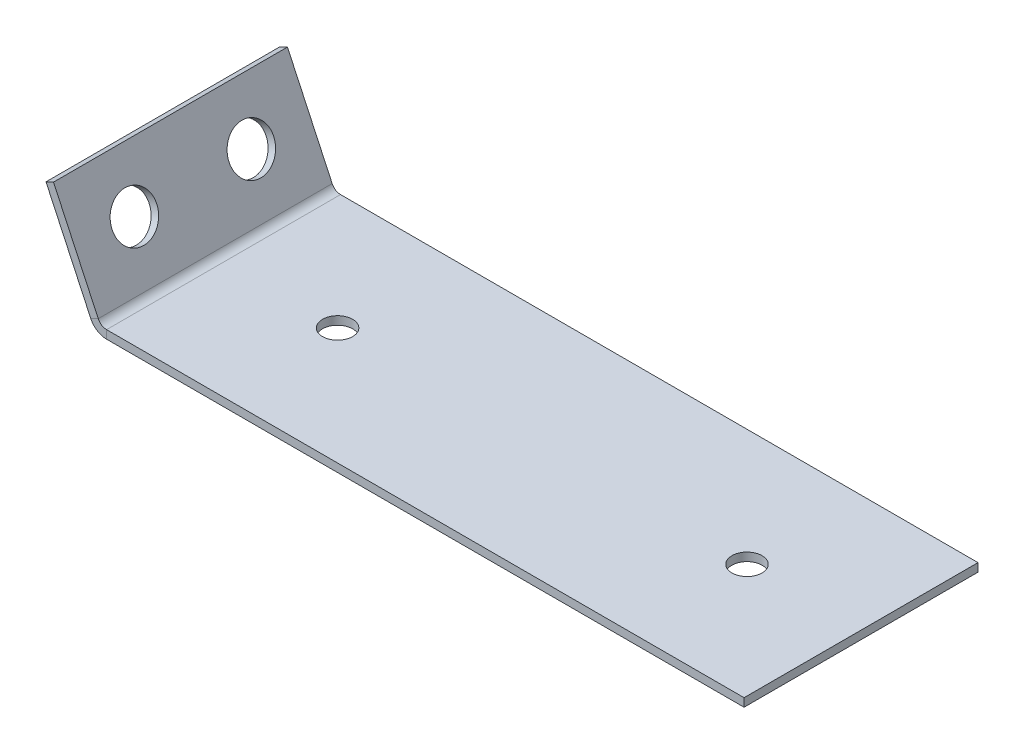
ISO-10303-21;
HEADER;
FILE_DESCRIPTION(('STEP AP214'),'2;1');
FILE_NAME('part.step','',(''),(''),'','','');
FILE_SCHEMA(('AUTOMOTIVE_DESIGN { 1 0 10303 214 1 1 1 1 }'));
ENDSEC;
DATA;
#1=APPLICATION_CONTEXT('core data for automotive mechanical design processes');
#2=APPLICATION_PROTOCOL_DEFINITION('international standard','automotive_design',2000,#1);
#3=PRODUCT_CONTEXT('',#1,'mechanical');
#4=PRODUCT('Part','Part','',(#3));
#5=PRODUCT_RELATED_PRODUCT_CATEGORY('part','',(#4));
#6=PRODUCT_DEFINITION_FORMATION('','',#4);
#7=PRODUCT_DEFINITION_CONTEXT('part definition',#1,'design');
#8=PRODUCT_DEFINITION('design','',#6,#7);
#9=PRODUCT_DEFINITION_SHAPE('','',#8);
#10=(LENGTH_UNIT() NAMED_UNIT(*) SI_UNIT(.MILLI.,.METRE.));
#11=(NAMED_UNIT(*) PLANE_ANGLE_UNIT() SI_UNIT($,.RADIAN.));
#12=(NAMED_UNIT(*) SI_UNIT($,.STERADIAN.) SOLID_ANGLE_UNIT());
#13=UNCERTAINTY_MEASURE_WITH_UNIT(LENGTH_MEASURE(1.E-05),#10,'distance_accuracy_value','');
#14=(GEOMETRIC_REPRESENTATION_CONTEXT(3) GLOBAL_UNCERTAINTY_ASSIGNED_CONTEXT((#13)) GLOBAL_UNIT_ASSIGNED_CONTEXT((#10,
#11,#12)) REPRESENTATION_CONTEXT('',''));
#15=CARTESIAN_POINT('',(0.,0.,0.));
#16=DIRECTION('',(0.,0.,1.));
#17=DIRECTION('',(1.,0.,0.));
#18=AXIS2_PLACEMENT_3D('',#15,#16,#17);
#19=CARTESIAN_POINT('',(0.,0.899999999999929,0.));
#20=DIRECTION('',(0.,0.,-1.));
#21=DIRECTION('',(-1.,0.,0.));
#22=AXIS2_PLACEMENT_3D('',#19,#20,#21);
#23=PLANE('',#22);
#24=DIRECTION('',(0.,-1.,0.));
#25=VECTOR('',#24,1.);
#26=CARTESIAN_POINT('',(0.637070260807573,0.899999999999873,0.));
#27=LINE('',#26,#25);
#28=CARTESIAN_POINT('',(0.637070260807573,0.899999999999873,0.));
#29=VERTEX_POINT('',#28);
#30=CARTESIAN_POINT('',(0.63707026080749,-1.11022302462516E-13,0.));
#31=VERTEX_POINT('',#30);
#32=EDGE_CURVE('E157',#29,#31,#27,.T.);
#33=ORIENTED_EDGE('',*,*,#32,.T.);
#34=DIRECTION('',(1.,0.,0.));
#35=VECTOR('',#34,1.);
#36=CARTESIAN_POINT('',(0.,0.,0.));
#37=LINE('',#36,#35);
#38=CARTESIAN_POINT('',(69.85,0.,0.));
#39=VERTEX_POINT('',#38);
#40=EDGE_CURVE('E78',#31,#39,#37,.T.);
#41=ORIENTED_EDGE('',*,*,#40,.T.);
#42=DIRECTION('',(0.,-1.,0.));
#43=VECTOR('',#42,1.);
#44=CARTESIAN_POINT('',(69.8500000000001,0.900000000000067,0.));
#45=LINE('',#44,#43);
#46=CARTESIAN_POINT('',(69.8500000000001,0.900000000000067,0.));
#47=VERTEX_POINT('',#46);
#48=EDGE_CURVE('E11',#47,#39,#45,.T.);
#49=ORIENTED_EDGE('',*,*,#48,.F.);
#50=DIRECTION('',(1.,0.,0.));
#51=VECTOR('',#50,1.);
#52=CARTESIAN_POINT('',(0.,0.899999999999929,0.));
#53=LINE('',#52,#51);
#54=EDGE_CURVE('E89',#29,#47,#53,.T.);
#55=ORIENTED_EDGE('',*,*,#54,.F.);
#56=EDGE_LOOP('',(#33,#41,#49,#55));
#57=FACE_BOUND('',#56,.T.);
#58=ADVANCED_FACE('F32',(#57),#23,.F.);
#59=CARTESIAN_POINT('',(0.,0.899999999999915,-25.4));
#60=DIRECTION('',(0.,0.,1.));
#61=DIRECTION('',(1.,0.,0.));
#62=AXIS2_PLACEMENT_3D('',#59,#60,#61);
#63=PLANE('',#62);
#64=DIRECTION('',(0.,-1.,0.));
#65=VECTOR('',#64,1.);
#66=CARTESIAN_POINT('',(0.637070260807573,0.899999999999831,-25.4));
#67=LINE('',#66,#65);
#68=CARTESIAN_POINT('',(0.637070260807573,0.899999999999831,-25.4));
#69=VERTEX_POINT('',#68);
#70=CARTESIAN_POINT('',(0.637070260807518,-1.66533453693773E-13,-25.4));
#71=VERTEX_POINT('',#70);
#72=EDGE_CURVE('E168',#69,#71,#67,.T.);
#73=ORIENTED_EDGE('',*,*,#72,.F.);
#74=DIRECTION('',(-1.,0.,0.));
#75=VECTOR('',#74,1.);
#76=CARTESIAN_POINT('',(0.,0.899999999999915,-25.4));
#77=LINE('',#76,#75);
#78=CARTESIAN_POINT('',(69.85,0.900000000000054,-25.4));
#79=VERTEX_POINT('',#78);
#80=EDGE_CURVE('E84',#79,#69,#77,.T.);
#81=ORIENTED_EDGE('',*,*,#80,.F.);
#82=DIRECTION('',(0.,-1.,0.));
#83=VECTOR('',#82,1.);
#84=CARTESIAN_POINT('',(69.85,0.900000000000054,-25.4));
#85=LINE('',#84,#83);
#86=CARTESIAN_POINT('',(69.85,0.,-25.4));
#87=VERTEX_POINT('',#86);
#88=EDGE_CURVE('E40',#79,#87,#85,.T.);
#89=ORIENTED_EDGE('',*,*,#88,.T.);
#90=DIRECTION('',(-1.,0.,0.));
#91=VECTOR('',#90,1.);
#92=CARTESIAN_POINT('',(0.,-1.66533453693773E-13,-25.4));
#93=LINE('',#92,#91);
#94=EDGE_CURVE('E77',#87,#71,#93,.T.);
#95=ORIENTED_EDGE('',*,*,#94,.T.);
#96=EDGE_LOOP('',(#73,#81,#89,#95));
#97=FACE_BOUND('',#96,.T.);
#98=ADVANCED_FACE('F83',(#97),#63,.F.);
#99=CARTESIAN_POINT('',(0.,0.899999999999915,-25.4));
#100=DIRECTION('',(0.,-1.,0.));
#101=DIRECTION('',(0.,0.,-1.));
#102=AXIS2_PLACEMENT_3D('',#99,#100,#101);
#103=PLANE('',#102);
#104=CARTESIAN_POINT('',(57.4685351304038,0.899999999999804,-12.7));
#105=DIRECTION('',(0.,1.,0.));
#106=DIRECTION('',(0.,0.,1.));
#107=AXIS2_PLACEMENT_3D('',#104,#105,#106);
#108=CIRCLE('',#107,1.63194999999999);
#109=CARTESIAN_POINT('',(57.4685351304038,0.899999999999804,-11.06805));
#110=VERTEX_POINT('',#109);
#111=EDGE_CURVE('E101',#110,#110,#108,.T.);
#112=ORIENTED_EDGE('',*,*,#111,.F.);
#113=EDGE_LOOP('',(#112));
#114=FACE_BOUND('',#113,.T.);
#115=CARTESIAN_POINT('',(13.0185351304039,0.899999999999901,-12.6999999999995));
#116=DIRECTION('',(0.,1.,0.));
#117=DIRECTION('',(0.,0.,1.));
#118=AXIS2_PLACEMENT_3D('',#115,#116,#117);
#119=CIRCLE('',#118,1.63194999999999);
#120=CARTESIAN_POINT('',(13.0185351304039,0.899999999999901,-11.0680499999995));
#121=VERTEX_POINT('',#120);
#122=EDGE_CURVE('E98',#121,#121,#119,.T.);
#123=ORIENTED_EDGE('',*,*,#122,.F.);
#124=EDGE_LOOP('',(#123));
#125=FACE_BOUND('',#124,.T.);
#126=DIRECTION('',(0.,0.,1.));
#127=VECTOR('',#126,1.);
#128=CARTESIAN_POINT('',(0.637070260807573,0.899999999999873,0.));
#129=LINE('',#128,#127);
#130=EDGE_CURVE('E163',#29,#69,#129,.F.);
#131=ORIENTED_EDGE('',*,*,#130,.F.);
#132=ORIENTED_EDGE('',*,*,#54,.T.);
#133=DIRECTION('',(0.,0.,-1.));
#134=VECTOR('',#133,1.);
#135=CARTESIAN_POINT('',(69.8500000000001,0.900000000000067,0.));
#136=LINE('',#135,#134);
#137=EDGE_CURVE('E57',#47,#79,#136,.T.);
#138=ORIENTED_EDGE('',*,*,#137,.T.);
#139=ORIENTED_EDGE('',*,*,#80,.T.);
#140=EDGE_LOOP('',(#131,#132,#138,#139));
#141=FACE_BOUND('',#140,.T.);
#142=ADVANCED_FACE('F229',(#114,#125,#141),#103,.F.);
#143=CARTESIAN_POINT('',(0.,-1.66533453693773E-13,-25.4));
#144=DIRECTION('',(0.,-1.,0.));
#145=DIRECTION('',(0.,0.,-1.));
#146=AXIS2_PLACEMENT_3D('',#143,#144,#145);
#147=PLANE('',#146);
#148=CARTESIAN_POINT('',(57.4685351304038,0.,-12.7));
#149=DIRECTION('',(0.,-1.,0.));
#150=DIRECTION('',(0.,0.,-1.));
#151=AXIS2_PLACEMENT_3D('',#148,#149,#150);
#152=CIRCLE('',#151,1.63194999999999);
#153=CARTESIAN_POINT('',(57.4685351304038,0.,-14.33195));
#154=VERTEX_POINT('',#153);
#155=EDGE_CURVE('E99',#154,#154,#152,.T.);
#156=ORIENTED_EDGE('',*,*,#155,.F.);
#157=EDGE_LOOP('',(#156));
#158=FACE_BOUND('',#157,.T.);
#159=CARTESIAN_POINT('',(13.0185351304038,0.,-12.6999999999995));
#160=DIRECTION('',(0.,-1.,0.));
#161=DIRECTION('',(0.,0.,-1.));
#162=AXIS2_PLACEMENT_3D('',#159,#160,#161);
#163=CIRCLE('',#162,1.63194999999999);
#164=CARTESIAN_POINT('',(13.0185351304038,0.,-14.3319499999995));
#165=VERTEX_POINT('',#164);
#166=EDGE_CURVE('E94',#165,#165,#163,.T.);
#167=ORIENTED_EDGE('',*,*,#166,.F.);
#168=EDGE_LOOP('',(#167));
#169=FACE_BOUND('',#168,.T.);
#170=ORIENTED_EDGE('',*,*,#40,.F.);
#171=DIRECTION('',(0.,0.,1.));
#172=VECTOR('',#171,1.);
#173=CARTESIAN_POINT('',(0.63707026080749,-1.11022302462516E-13,0.));
#174=LINE('',#173,#172);
#175=EDGE_CURVE('E88',#31,#71,#174,.F.);
#176=ORIENTED_EDGE('',*,*,#175,.T.);
#177=ORIENTED_EDGE('',*,*,#94,.F.);
#178=DIRECTION('',(0.,0.,-1.));
#179=VECTOR('',#178,1.);
#180=CARTESIAN_POINT('',(69.85,0.,0.));
#181=LINE('',#180,#179);
#182=EDGE_CURVE('E69',#39,#87,#181,.T.);
#183=ORIENTED_EDGE('',*,*,#182,.F.);
#184=EDGE_LOOP('',(#170,#176,#177,#183));
#185=FACE_BOUND('',#184,.T.);
#186=ADVANCED_FACE('F87',(#158,#169,#185),#147,.T.);
#187=CARTESIAN_POINT('',(69.8500000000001,0.900000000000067,0.));
#188=DIRECTION('',(-1.,0.,0.));
#189=DIRECTION('',(0.,0.,1.));
#190=AXIS2_PLACEMENT_3D('',#187,#188,#189);
#191=PLANE('',#190);
#192=ORIENTED_EDGE('',*,*,#182,.T.);
#193=ORIENTED_EDGE('',*,*,#88,.F.);
#194=ORIENTED_EDGE('',*,*,#137,.F.);
#195=ORIENTED_EDGE('',*,*,#48,.T.);
#196=EDGE_LOOP('',(#192,#193,#194,#195));
#197=FACE_BOUND('',#196,.T.);
#198=ADVANCED_FACE('F71',(#197),#191,.F.);
#199=CARTESIAN_POINT('',(0.637070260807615,1.89999999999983,-25.4));
#200=DIRECTION('',(0.,0.,-1.));
#201=DIRECTION('',(0.,1.,0.));
#202=AXIS2_PLACEMENT_3D('',#199,#200,#201);
#203=PLANE('',#202);
#204=DIRECTION('',(-0.906307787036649,-0.422618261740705,0.));
#205=VECTOR('',#204,1.);
#206=CARTESIAN_POINT('',(-0.269237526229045,1.47738173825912,-25.4));
#207=LINE('',#206,#205);
#208=CARTESIAN_POINT('',(-0.269237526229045,1.47738173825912,-25.4));
#209=VERTEX_POINT('',#208);
#210=CARTESIAN_POINT('',(-1.08491453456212,1.09702530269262,-25.4));
#211=VERTEX_POINT('',#210);
#212=EDGE_CURVE('E97',#209,#211,#207,.T.);
#213=ORIENTED_EDGE('',*,*,#212,.F.);
#214=CARTESIAN_POINT('',(0.637070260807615,1.89999999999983,-25.4));
#215=DIRECTION('',(0.,0.,1.));
#216=DIRECTION('',(0.,-1.,0.));
#217=AXIS2_PLACEMENT_3D('',#214,#215,#216);
#218=CIRCLE('',#217,1.);
#219=EDGE_CURVE('E160',#69,#209,#218,.F.);
#220=ORIENTED_EDGE('',*,*,#219,.F.);
#221=ORIENTED_EDGE('',*,*,#72,.T.);
#222=CARTESIAN_POINT('',(0.637070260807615,1.89999999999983,-25.4));
#223=DIRECTION('',(0.,0.,1.));
#224=DIRECTION('',(0.,-1.,0.));
#225=AXIS2_PLACEMENT_3D('',#222,#223,#224);
#226=CIRCLE('',#225,1.9);
#227=EDGE_CURVE('E48',#71,#211,#226,.F.);
#228=ORIENTED_EDGE('',*,*,#227,.T.);
#229=EDGE_LOOP('',(#213,#220,#221,#228));
#230=FACE_BOUND('',#229,.T.);
#231=ADVANCED_FACE('F228',(#230),#203,.T.);
#232=CARTESIAN_POINT('',(0.637070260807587,1.89999999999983,0.));
#233=DIRECTION('',(0.,0.,-1.));
#234=DIRECTION('',(0.,1.,0.));
#235=AXIS2_PLACEMENT_3D('',#232,#233,#234);
#236=PLANE('',#235);
#237=CARTESIAN_POINT('',(0.637070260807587,1.89999999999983,0.));
#238=DIRECTION('',(0.,0.,1.));
#239=DIRECTION('',(0.,-1.,0.));
#240=AXIS2_PLACEMENT_3D('',#237,#238,#239);
#241=CIRCLE('',#240,1.);
#242=CARTESIAN_POINT('',(-0.269237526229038,1.47738173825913,0.));
#243=VERTEX_POINT('',#242);
#244=EDGE_CURVE('E153',#243,#29,#241,.T.);
#245=ORIENTED_EDGE('',*,*,#244,.F.);
#246=DIRECTION('',(-0.906307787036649,-0.422618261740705,0.));
#247=VECTOR('',#246,1.);
#248=CARTESIAN_POINT('',(-0.269237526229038,1.47738173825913,0.));
#249=LINE('',#248,#247);
#250=CARTESIAN_POINT('',(-1.08491453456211,1.09702530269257,0.));
#251=VERTEX_POINT('',#250);
#252=EDGE_CURVE('E122',#243,#251,#249,.T.);
#253=ORIENTED_EDGE('',*,*,#252,.T.);
#254=CARTESIAN_POINT('',(0.637070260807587,1.89999999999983,0.));
#255=DIRECTION('',(0.,0.,1.));
#256=DIRECTION('',(0.,-1.,0.));
#257=AXIS2_PLACEMENT_3D('',#254,#255,#256);
#258=CIRCLE('',#257,1.9);
#259=EDGE_CURVE('E155',#251,#31,#258,.T.);
#260=ORIENTED_EDGE('',*,*,#259,.T.);
#261=ORIENTED_EDGE('',*,*,#32,.F.);
#262=EDGE_LOOP('',(#245,#253,#260,#261));
#263=FACE_BOUND('',#262,.T.);
#264=ADVANCED_FACE('F201',(#263),#236,.F.);
#265=CARTESIAN_POINT('',(0.637070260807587,1.89999999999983,0.));
#266=DIRECTION('',(0.,0.,1.));
#267=DIRECTION('',(-0.906307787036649,-0.422618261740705,0.));
#268=AXIS2_PLACEMENT_3D('',#265,#266,#267);
#269=CYLINDRICAL_SURFACE('',#268,1.9);
#270=ORIENTED_EDGE('',*,*,#175,.F.);
#271=ORIENTED_EDGE('',*,*,#259,.F.);
#272=DIRECTION('',(0.,0.,-1.));
#273=VECTOR('',#272,1.);
#274=CARTESIAN_POINT('',(-1.08491453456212,1.09702530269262,-25.4));
#275=LINE('',#274,#273);
#276=EDGE_CURVE('E125',#251,#211,#275,.T.);
#277=ORIENTED_EDGE('',*,*,#276,.T.);
#278=ORIENTED_EDGE('',*,*,#227,.F.);
#279=EDGE_LOOP('',(#270,#271,#277,#278));
#280=FACE_BOUND('',#279,.T.);
#281=ADVANCED_FACE('F226',(#280),#269,.T.);
#282=CARTESIAN_POINT('',(0.637070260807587,1.89999999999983,0.));
#283=DIRECTION('',(0.,0.,1.));
#284=DIRECTION('',(-0.906307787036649,-0.422618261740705,0.));
#285=AXIS2_PLACEMENT_3D('',#282,#283,#284);
#286=CYLINDRICAL_SURFACE('',#285,1.);
#287=ORIENTED_EDGE('',*,*,#130,.T.);
#288=ORIENTED_EDGE('',*,*,#219,.T.);
#289=DIRECTION('',(0.,0.,1.));
#290=VECTOR('',#289,1.);
#291=CARTESIAN_POINT('',(-0.269237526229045,1.47738173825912,-25.4));
#292=LINE('',#291,#290);
#293=EDGE_CURVE('E119',#209,#243,#292,.T.);
#294=ORIENTED_EDGE('',*,*,#293,.T.);
#295=ORIENTED_EDGE('',*,*,#244,.T.);
#296=EDGE_LOOP('',(#287,#288,#294,#295));
#297=FACE_BOUND('',#296,.T.);
#298=ADVANCED_FACE('F193',(#297),#286,.F.);
#299=CARTESIAN_POINT('',(-0.815677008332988,0.519643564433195,-25.4));
#300=DIRECTION('',(0.,0.,1.));
#301=DIRECTION('',(1.,0.,0.));
#302=AXIS2_PLACEMENT_3D('',#299,#300,#301);
#303=PLANE('',#302);
#304=ORIENTED_EDGE('',*,*,#212,.T.);
#305=DIRECTION('',(0.422618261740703,-0.906307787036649,0.));
#306=VECTOR('',#305,1.);
#307=CARTESIAN_POINT('',(-0.815677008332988,0.519643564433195,-25.4));
#308=LINE('',#307,#306);
#309=CARTESIAN_POINT('',(-5.94061515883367,11.5101088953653,-25.4));
#310=VERTEX_POINT('',#309);
#311=EDGE_CURVE('E130',#310,#211,#308,.T.);
#312=ORIENTED_EDGE('',*,*,#311,.F.);
#313=DIRECTION('',(0.906307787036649,0.422618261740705,0.));
#314=VECTOR('',#313,1.);
#315=CARTESIAN_POINT('',(-5.94061515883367,11.5101088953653,-25.4));
#316=LINE('',#315,#314);
#317=CARTESIAN_POINT('',(-5.12493815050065,11.8904653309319,-25.4));
#318=VERTEX_POINT('',#317);
#319=EDGE_CURVE('E140',#310,#318,#316,.T.);
#320=ORIENTED_EDGE('',*,*,#319,.T.);
#321=DIRECTION('',(0.422618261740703,-0.906307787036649,0.));
#322=VECTOR('',#321,1.);
#323=CARTESIAN_POINT('',(0.,0.899999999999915,-25.4));
#324=LINE('',#323,#322);
#325=EDGE_CURVE('E129',#318,#209,#324,.T.);
#326=ORIENTED_EDGE('',*,*,#325,.T.);
#327=EDGE_LOOP('',(#304,#312,#320,#326));
#328=FACE_BOUND('',#327,.T.);
#329=ADVANCED_FACE('F220',(#328),#303,.F.);
#330=CARTESIAN_POINT('',(-5.94061515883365,11.5101088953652,0.));
#331=DIRECTION('',(0.,0.,-1.));
#332=DIRECTION('',(-1.,0.,0.));
#333=AXIS2_PLACEMENT_3D('',#330,#331,#332);
#334=PLANE('',#333);
#335=ORIENTED_EDGE('',*,*,#252,.F.);
#336=DIRECTION('',(-0.422618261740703,0.906307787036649,0.));
#337=VECTOR('',#336,1.);
#338=CARTESIAN_POINT('',(-5.12493815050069,11.8904653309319,0.));
#339=LINE('',#338,#337);
#340=CARTESIAN_POINT('',(-5.12493815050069,11.8904653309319,0.));
#341=VERTEX_POINT('',#340);
#342=EDGE_CURVE('E143',#243,#341,#339,.T.);
#343=ORIENTED_EDGE('',*,*,#342,.T.);
#344=DIRECTION('',(0.906307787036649,0.422618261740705,0.));
#345=VECTOR('',#344,1.);
#346=CARTESIAN_POINT('',(-5.94061515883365,11.5101088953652,0.));
#347=LINE('',#346,#345);
#348=CARTESIAN_POINT('',(-5.94061515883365,11.5101088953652,0.));
#349=VERTEX_POINT('',#348);
#350=EDGE_CURVE('E150',#349,#341,#347,.T.);
#351=ORIENTED_EDGE('',*,*,#350,.F.);
#352=DIRECTION('',(-0.422618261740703,0.906307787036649,0.));
#353=VECTOR('',#352,1.);
#354=CARTESIAN_POINT('',(-5.94061515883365,11.5101088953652,0.));
#355=LINE('',#354,#353);
#356=EDGE_CURVE('E133',#251,#349,#355,.T.);
#357=ORIENTED_EDGE('',*,*,#356,.F.);
#358=EDGE_LOOP('',(#335,#343,#351,#357));
#359=FACE_BOUND('',#358,.T.);
#360=ADVANCED_FACE('F206',(#359),#334,.F.);
#361=CARTESIAN_POINT('',(-5.94061515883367,11.5101088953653,-25.4));
#362=DIRECTION('',(0.906307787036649,0.422618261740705,0.));
#363=DIRECTION('',(-0.422618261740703,0.906307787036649,0.));
#364=AXIS2_PLACEMENT_3D('',#361,#362,#363);
#365=PLANE('',#364);
#366=CARTESIAN_POINT('',(-3.51276484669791,6.30356709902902,-6.34999999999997));
#367=DIRECTION('',(-0.906307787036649,-0.422618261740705,0.));
#368=DIRECTION('',(0.422618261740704,-0.906307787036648,0.));
#369=AXIS2_PLACEMENT_3D('',#366,#367,#368);
#370=CIRCLE('',#369,2.4257);
#371=CARTESIAN_POINT('',(-2.48761972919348,4.10513630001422,-6.34999999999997));
#372=VERTEX_POINT('',#371);
#373=EDGE_CURVE('E114',#372,#372,#370,.T.);
#374=ORIENTED_EDGE('',*,*,#373,.F.);
#375=EDGE_LOOP('',(#374));
#376=FACE_BOUND('',#375,.T.);
#377=CARTESIAN_POINT('',(-3.51276484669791,6.30356709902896,-19.05));
#378=DIRECTION('',(-0.906307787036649,-0.422618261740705,0.));
#379=DIRECTION('',(0.422618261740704,-0.906307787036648,0.));
#380=AXIS2_PLACEMENT_3D('',#377,#378,#379);
#381=CIRCLE('',#380,2.4257);
#382=CARTESIAN_POINT('',(-2.48761972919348,4.10513630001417,-19.05));
#383=VERTEX_POINT('',#382);
#384=EDGE_CURVE('E104',#383,#383,#381,.T.);
#385=ORIENTED_EDGE('',*,*,#384,.F.);
#386=EDGE_LOOP('',(#385));
#387=FACE_BOUND('',#386,.T.);
#388=ORIENTED_EDGE('',*,*,#276,.F.);
#389=ORIENTED_EDGE('',*,*,#356,.T.);
#390=DIRECTION('',(0.,0.,-1.));
#391=VECTOR('',#390,1.);
#392=CARTESIAN_POINT('',(-5.94061515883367,11.5101088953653,-25.4));
#393=LINE('',#392,#391);
#394=EDGE_CURVE('E137',#349,#310,#393,.T.);
#395=ORIENTED_EDGE('',*,*,#394,.T.);
#396=ORIENTED_EDGE('',*,*,#311,.T.);
#397=EDGE_LOOP('',(#388,#389,#395,#396));
#398=FACE_BOUND('',#397,.T.);
#399=ADVANCED_FACE('F223',(#376,#387,#398),#365,.F.);
#400=CARTESIAN_POINT('',(-5.12493815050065,11.8904653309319,-25.4));
#401=DIRECTION('',(0.906307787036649,0.422618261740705,0.));
#402=DIRECTION('',(-0.422618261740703,0.906307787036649,0.));
#403=AXIS2_PLACEMENT_3D('',#400,#401,#402);
#404=PLANE('',#403);
#405=CARTESIAN_POINT('',(-2.69708783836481,6.68392353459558,-6.34999999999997));
#406=DIRECTION('',(0.906307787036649,0.422618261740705,0.));
#407=DIRECTION('',(-0.422618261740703,0.906307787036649,0.));
#408=AXIS2_PLACEMENT_3D('',#405,#406,#407);
#409=CIRCLE('',#408,2.4257);
#410=CARTESIAN_POINT('',(-3.72223295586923,8.88235433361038,-6.34999999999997));
#411=VERTEX_POINT('',#410);
#412=EDGE_CURVE('E35',#411,#411,#409,.T.);
#413=ORIENTED_EDGE('',*,*,#412,.F.);
#414=EDGE_LOOP('',(#413));
#415=FACE_BOUND('',#414,.T.);
#416=CARTESIAN_POINT('',(-2.69708783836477,6.68392353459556,-19.05));
#417=DIRECTION('',(0.906307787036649,0.422618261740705,0.));
#418=DIRECTION('',(-0.422618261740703,0.906307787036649,0.));
#419=AXIS2_PLACEMENT_3D('',#416,#417,#418);
#420=CIRCLE('',#419,2.4257);
#421=CARTESIAN_POINT('',(-3.72223295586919,8.88235433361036,-19.05));
#422=VERTEX_POINT('',#421);
#423=EDGE_CURVE('E102',#422,#422,#420,.T.);
#424=ORIENTED_EDGE('',*,*,#423,.F.);
#425=EDGE_LOOP('',(#424));
#426=FACE_BOUND('',#425,.T.);
#427=ORIENTED_EDGE('',*,*,#342,.F.);
#428=ORIENTED_EDGE('',*,*,#293,.F.);
#429=ORIENTED_EDGE('',*,*,#325,.F.);
#430=DIRECTION('',(0.,0.,-1.));
#431=VECTOR('',#430,1.);
#432=CARTESIAN_POINT('',(-5.12493815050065,11.8904653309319,-25.4));
#433=LINE('',#432,#431);
#434=EDGE_CURVE('E134',#341,#318,#433,.T.);
#435=ORIENTED_EDGE('',*,*,#434,.F.);
#436=EDGE_LOOP('',(#427,#428,#429,#435));
#437=FACE_BOUND('',#436,.T.);
#438=ADVANCED_FACE('F210',(#415,#426,#437),#404,.T.);
#439=CARTESIAN_POINT('',(-5.94061515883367,11.5101088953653,-25.4));
#440=DIRECTION('',(0.422618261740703,-0.906307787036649,0.));
#441=DIRECTION('',(0.906307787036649,0.422618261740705,0.));
#442=AXIS2_PLACEMENT_3D('',#439,#440,#441);
#443=PLANE('',#442);
#444=ORIENTED_EDGE('',*,*,#434,.T.);
#445=ORIENTED_EDGE('',*,*,#319,.F.);
#446=ORIENTED_EDGE('',*,*,#394,.F.);
#447=ORIENTED_EDGE('',*,*,#350,.T.);
#448=EDGE_LOOP('',(#444,#445,#446,#447));
#449=FACE_BOUND('',#448,.T.);
#450=ADVANCED_FACE('F215',(#449),#443,.F.);
#451=CARTESIAN_POINT('',(13.0185351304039,0.899999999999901,-12.6999999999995));
#452=DIRECTION('',(0.,1.,0.));
#453=DIRECTION('',(0.,0.,1.));
#454=AXIS2_PLACEMENT_3D('',#451,#452,#453);
#455=CYLINDRICAL_SURFACE('',#454,1.63194999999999);
#456=ORIENTED_EDGE('',*,*,#166,.T.);
#457=EDGE_LOOP('',(#456));
#458=FACE_BOUND('',#457,.T.);
#459=ORIENTED_EDGE('',*,*,#122,.T.);
#460=EDGE_LOOP('',(#459));
#461=FACE_BOUND('',#460,.T.);
#462=ADVANCED_FACE('F332',(#458,#461),#455,.F.);
#463=CARTESIAN_POINT('',(57.4685351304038,0.899999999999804,-12.7));
#464=DIRECTION('',(0.,1.,0.));
#465=DIRECTION('',(0.,0.,1.));
#466=AXIS2_PLACEMENT_3D('',#463,#464,#465);
#467=CYLINDRICAL_SURFACE('',#466,1.63194999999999);
#468=ORIENTED_EDGE('',*,*,#155,.T.);
#469=EDGE_LOOP('',(#468));
#470=FACE_BOUND('',#469,.T.);
#471=ORIENTED_EDGE('',*,*,#111,.T.);
#472=EDGE_LOOP('',(#471));
#473=FACE_BOUND('',#472,.T.);
#474=ADVANCED_FACE('F340',(#470,#473),#467,.F.);
#475=CARTESIAN_POINT('',(-3.51276484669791,6.30356709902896,-19.05));
#476=DIRECTION('',(-0.906307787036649,-0.422618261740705,0.));
#477=DIRECTION('',(0.422618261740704,-0.906307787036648,0.));
#478=AXIS2_PLACEMENT_3D('',#475,#476,#477);
#479=CYLINDRICAL_SURFACE('',#478,2.4257);
#480=ORIENTED_EDGE('',*,*,#423,.T.);
#481=EDGE_LOOP('',(#480));
#482=FACE_BOUND('',#481,.T.);
#483=ORIENTED_EDGE('',*,*,#384,.T.);
#484=EDGE_LOOP('',(#483));
#485=FACE_BOUND('',#484,.T.);
#486=ADVANCED_FACE('F348',(#482,#485),#479,.F.);
#487=CARTESIAN_POINT('',(-3.51276484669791,6.30356709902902,-6.34999999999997));
#488=DIRECTION('',(-0.906307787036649,-0.422618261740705,0.));
#489=DIRECTION('',(0.422618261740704,-0.906307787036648,0.));
#490=AXIS2_PLACEMENT_3D('',#487,#488,#489);
#491=CYLINDRICAL_SURFACE('',#490,2.4257);
#492=ORIENTED_EDGE('',*,*,#412,.T.);
#493=EDGE_LOOP('',(#492));
#494=FACE_BOUND('',#493,.T.);
#495=ORIENTED_EDGE('',*,*,#373,.T.);
#496=EDGE_LOOP('',(#495));
#497=FACE_BOUND('',#496,.T.);
#498=ADVANCED_FACE('F356',(#494,#497),#491,.F.);
#499=CLOSED_SHELL('',(#58,#98,#142,#186,#198,#231,#264,#281,#298,#329,#360,#399,#438,#450,#462,
#474,#486,#498));
#500=MANIFOLD_SOLID_BREP('B2',#499);
#501=ADVANCED_BREP_SHAPE_REPRESENTATION('',(#18,#500),#14);
#502=SHAPE_DEFINITION_REPRESENTATION(#9,#501);
ENDSEC;
END-ISO-10303-21;
